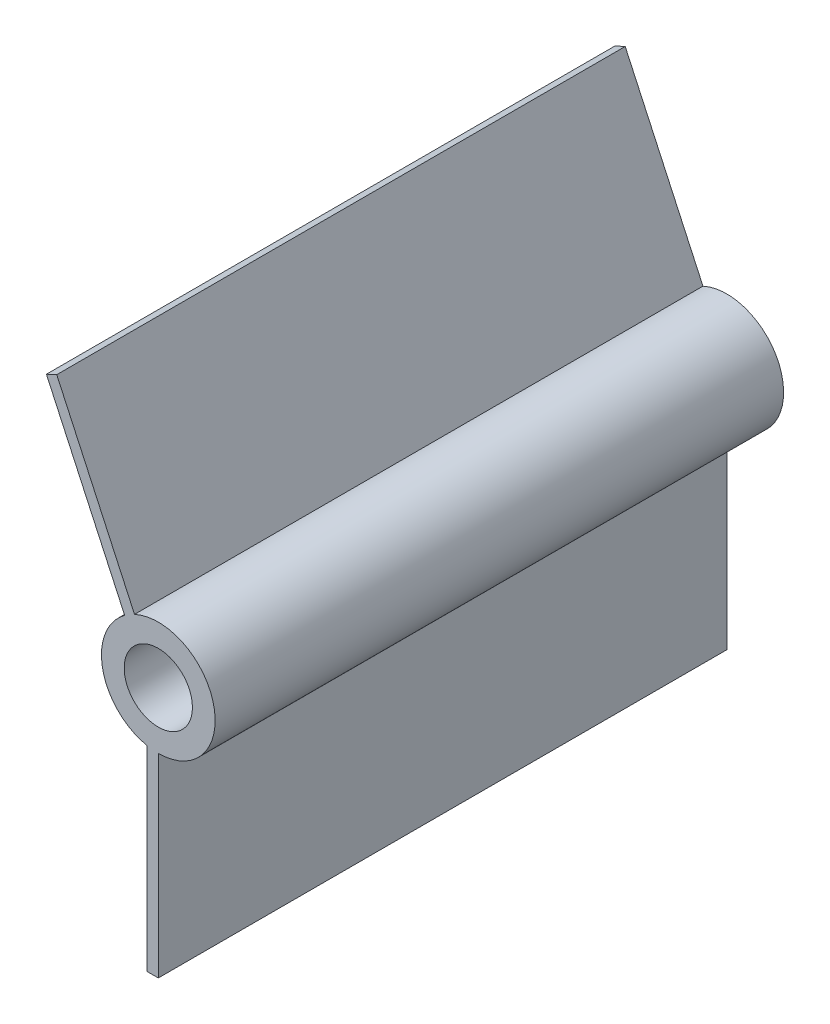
from build123d import *

# Parameters (mm, degrees)
EXTRUDE_1_DEPTH          = 50
SKETCH_2_R               = 10
EXTRUDE_1_2_DEPTH        = 50
CUT_EXTRUDE_1_DEPTH      = 112.099915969
CUT_EXTRUDE_1_DEPTH_BACK = 112.099915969
SKETCH_3_R               = 6


with BuildPart() as part:
    # Sketch 1 → Extrude 1 (new, symmetric)
    with BuildSketch(Plane.XY):
        Polygon((-17.865564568, 38.757536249), (0, 0), (0, -44.224594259), (-2, -44.224594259), (-2, -0.438771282), (-19.681884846, 37.920290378), align=None)
    extrude(amount=EXTRUDE_1_DEPTH, both=True)

    # Sketch 2 → Extrude 1 2 (add, symmetric)
    with BuildSketch(Plane.XY):
        Circle(SKETCH_2_R)
    extrude(amount=EXTRUDE_1_2_DEPTH, both=True)

    # Sketch 3 → Cut-Extrude 1 (cut, two sides: drawn at the far end of the back side and taken through both)
    with BuildSketch(Plane.XY.offset(50).offset(-CUT_EXTRUDE_1_DEPTH_BACK)):
        Circle(SKETCH_3_R)
    extrude(amount=CUT_EXTRUDE_1_DEPTH + CUT_EXTRUDE_1_DEPTH_BACK, mode=Mode.SUBTRACT)


solid = part.part
